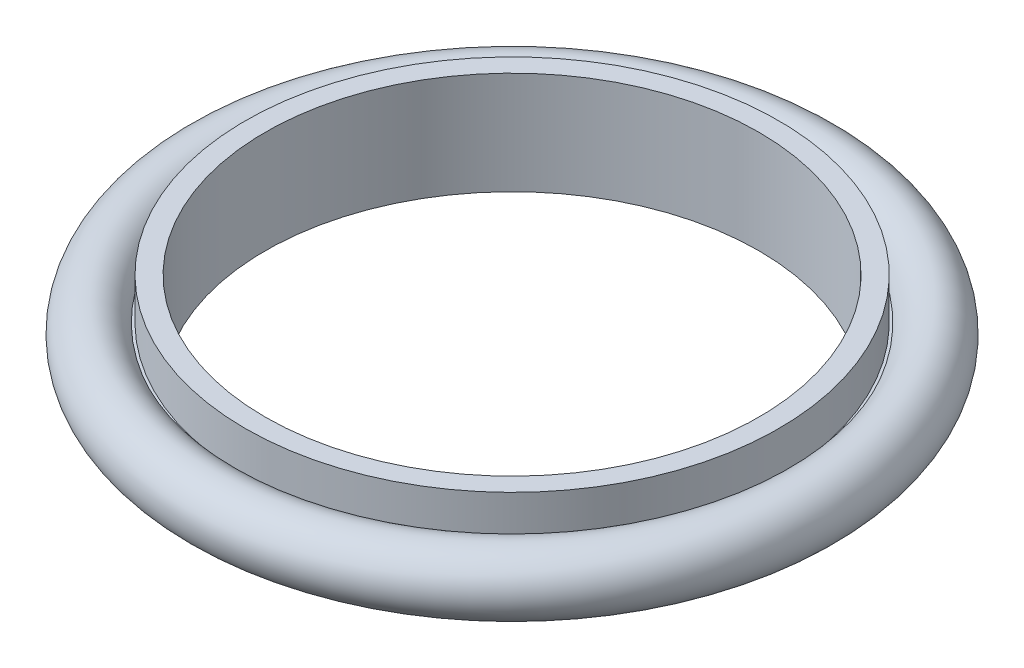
ISO-10303-21;
HEADER;
FILE_DESCRIPTION(('STEP AP214'),'2;1');
FILE_NAME('part.step','',(''),(''),'','','');
FILE_SCHEMA(('AUTOMOTIVE_DESIGN { 1 0 10303 214 1 1 1 1 }'));
ENDSEC;
DATA;
#1=APPLICATION_CONTEXT('core data for automotive mechanical design processes');
#2=APPLICATION_PROTOCOL_DEFINITION('international standard','automotive_design',2000,#1);
#3=PRODUCT_CONTEXT('',#1,'mechanical');
#4=PRODUCT('Part','Part','',(#3));
#5=PRODUCT_RELATED_PRODUCT_CATEGORY('part','',(#4));
#6=PRODUCT_DEFINITION_FORMATION('','',#4);
#7=PRODUCT_DEFINITION_CONTEXT('part definition',#1,'design');
#8=PRODUCT_DEFINITION('design','',#6,#7);
#9=PRODUCT_DEFINITION_SHAPE('','',#8);
#10=(LENGTH_UNIT() NAMED_UNIT(*) SI_UNIT(.MILLI.,.METRE.));
#11=(NAMED_UNIT(*) PLANE_ANGLE_UNIT() SI_UNIT($,.RADIAN.));
#12=(NAMED_UNIT(*) SI_UNIT($,.STERADIAN.) SOLID_ANGLE_UNIT());
#13=UNCERTAINTY_MEASURE_WITH_UNIT(LENGTH_MEASURE(1.E-05),#10,'distance_accuracy_value','');
#14=(GEOMETRIC_REPRESENTATION_CONTEXT(3) GLOBAL_UNCERTAINTY_ASSIGNED_CONTEXT((#13)) GLOBAL_UNIT_ASSIGNED_CONTEXT((#10,
#11,#12)) REPRESENTATION_CONTEXT('',''));
#15=CARTESIAN_POINT('',(0.,0.,0.));
#16=DIRECTION('',(0.,0.,1.));
#17=DIRECTION('',(1.,0.,0.));
#18=AXIS2_PLACEMENT_3D('',#15,#16,#17);
#19=CARTESIAN_POINT('',(0.,0.,0.));
#20=DIRECTION('',(0.,0.999999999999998,0.));
#21=DIRECTION('',(0.,0.,1.));
#22=AXIS2_PLACEMENT_3D('',#19,#20,#21);
#23=CYLINDRICAL_SURFACE('',#22,18.923);
#24=CARTESIAN_POINT('',(0.,0.,0.));
#25=DIRECTION('',(0.,0.999999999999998,0.));
#26=DIRECTION('',(0.,0.,1.));
#27=AXIS2_PLACEMENT_3D('',#24,#25,#26);
#28=CIRCLE('',#27,18.923);
#29=CARTESIAN_POINT('',(0.,0.,18.923));
#30=VERTEX_POINT('',#29);
#31=EDGE_CURVE('E10',#30,#30,#28,.T.);
#32=CARTESIAN_POINT('',(1.11022302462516E-13,7.87399999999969,2.16493489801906E-12));
#33=DIRECTION('',(0.,0.999999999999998,0.));
#34=DIRECTION('',(0.,0.,1.));
#35=AXIS2_PLACEMENT_3D('',#32,#33,#34);
#36=CIRCLE('',#35,18.923);
#37=CARTESIAN_POINT('',(0.,7.87399999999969,18.923));
#38=VERTEX_POINT('',#37);
#39=EDGE_CURVE('E60',#38,#38,#36,.T.);
#40=CARTESIAN_POINT('',(0.,0.,18.923));
#41=CARTESIAN_POINT('',(0.,0.0820208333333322,18.923));
#42=CARTESIAN_POINT('',(0.,0.164041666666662,18.923));
#43=CARTESIAN_POINT('',(0.,0.328083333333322,18.923));
#44=CARTESIAN_POINT('',(0.,0.410104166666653,18.923));
#45=CARTESIAN_POINT('',(0.,0.574145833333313,18.923));
#46=CARTESIAN_POINT('',(0.,0.656166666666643,18.923));
#47=CARTESIAN_POINT('',(0.,0.820208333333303,18.923));
#48=CARTESIAN_POINT('',(0.,0.902229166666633,18.923));
#49=CARTESIAN_POINT('',(0.,1.06627083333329,18.923));
#50=CARTESIAN_POINT('',(0.,1.14829166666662,18.923));
#51=CARTESIAN_POINT('',(0.,1.31233333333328,18.923));
#52=CARTESIAN_POINT('',(0.,1.39435416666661,18.923));
#53=CARTESIAN_POINT('',(0.,1.55839583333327,18.923));
#54=CARTESIAN_POINT('',(0.,1.6404166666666,18.923));
#55=CARTESIAN_POINT('',(0.,1.80445833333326,18.923));
#56=CARTESIAN_POINT('',(0.,1.88647916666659,18.923));
#57=CARTESIAN_POINT('',(0.,2.05052083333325,18.923));
#58=CARTESIAN_POINT('',(0.,2.13254166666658,18.923));
#59=CARTESIAN_POINT('',(0.,2.29658333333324,18.923));
#60=CARTESIAN_POINT('',(0.,2.37860416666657,18.923));
#61=CARTESIAN_POINT('',(0.,2.54264583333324,18.923));
#62=CARTESIAN_POINT('',(0.,2.62466666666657,18.923));
#63=CARTESIAN_POINT('',(0.,2.78870833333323,18.923));
#64=CARTESIAN_POINT('',(0.,2.87072916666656,18.923));
#65=CARTESIAN_POINT('',(0.,3.03477083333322,18.923));
#66=CARTESIAN_POINT('',(0.,3.11679166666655,18.923));
#67=CARTESIAN_POINT('',(0.,3.28083333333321,18.923));
#68=CARTESIAN_POINT('',(0.,3.36285416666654,18.923));
#69=CARTESIAN_POINT('',(0.,3.5268958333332,18.923));
#70=CARTESIAN_POINT('',(0.,3.60891666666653,18.923));
#71=CARTESIAN_POINT('',(0.,3.77295833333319,18.923));
#72=CARTESIAN_POINT('',(0.,3.85497916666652,18.923));
#73=CARTESIAN_POINT('',(0.,4.01902083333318,18.923));
#74=CARTESIAN_POINT('',(0.,4.10104166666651,18.923));
#75=CARTESIAN_POINT('',(0.,4.26508333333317,18.923));
#76=CARTESIAN_POINT('',(0.,4.3471041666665,18.923));
#77=CARTESIAN_POINT('',(0.,4.51114583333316,18.923));
#78=CARTESIAN_POINT('',(0.,4.59316666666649,18.923));
#79=CARTESIAN_POINT('',(0.,4.75720833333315,18.923));
#80=CARTESIAN_POINT('',(0.,4.83922916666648,18.923));
#81=CARTESIAN_POINT('',(0.,5.00327083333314,18.923));
#82=CARTESIAN_POINT('',(0.,5.08529166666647,18.923));
#83=CARTESIAN_POINT('',(0.,5.24933333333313,18.923));
#84=CARTESIAN_POINT('',(0.,5.33135416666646,18.923));
#85=CARTESIAN_POINT('',(0.,5.49539583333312,18.923));
#86=CARTESIAN_POINT('',(0.,5.57741666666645,18.923));
#87=CARTESIAN_POINT('',(0.,5.74145833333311,18.923));
#88=CARTESIAN_POINT('',(0.,5.82347916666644,18.923));
#89=CARTESIAN_POINT('',(0.,5.9875208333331,18.923));
#90=CARTESIAN_POINT('',(0.,6.06954166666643,18.923));
#91=CARTESIAN_POINT('',(0.,6.23358333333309,18.923));
#92=CARTESIAN_POINT('',(0.,6.31560416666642,18.923));
#93=CARTESIAN_POINT('',(0.,6.47964583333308,18.923));
#94=CARTESIAN_POINT('',(0.,6.56166666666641,18.923));
#95=CARTESIAN_POINT('',(0.,6.72570833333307,18.923));
#96=CARTESIAN_POINT('',(0.,6.8077291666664,18.923));
#97=CARTESIAN_POINT('',(0.,6.97177083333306,18.923));
#98=CARTESIAN_POINT('',(0.,7.05379166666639,18.923));
#99=CARTESIAN_POINT('',(0.,7.21783333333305,18.923));
#100=CARTESIAN_POINT('',(0.,7.29985416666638,18.923));
#101=CARTESIAN_POINT('',(0.,7.46389583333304,18.923));
#102=CARTESIAN_POINT('',(0.,7.54591666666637,18.923));
#103=CARTESIAN_POINT('',(0.,7.70995833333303,18.923));
#104=CARTESIAN_POINT('',(0.,7.79197916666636,18.923));
#105=CARTESIAN_POINT('',(0.,7.87399999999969,18.923));
#106=B_SPLINE_CURVE_WITH_KNOTS('',3,(#40,#41,#42,#43,#44,#45,#46,#47,#48,#49,#50,#51,#52,#53,
#54,#55,#56,#57,#58,#59,#60,#61,#62,#63,#64,#65,#66,#67,#68,#69,#70,#71,#72,#73,#74,#75,#76,#77,
#78,#79,#80,#81,#82,#83,#84,#85,#86,#87,#88,#89,#90,#91,#92,#93,#94,#95,#96,#97,#98,#99,#100,
#101,#102,#103,#104,#105),.UNSPECIFIED.,.F.,.F.,(4,2,2,2,2,2,2,2,2,2,2,2,2,2,2,2,2,2,2,2,2,2,2,
2,2,2,2,2,2,2,2,2,4),(0.,0.24606249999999,0.492124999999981,0.738187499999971,0.984249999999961,
1.23031249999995,1.47637499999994,1.72243749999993,1.96849999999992,2.21456249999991,
2.4606249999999,2.70668749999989,2.95274999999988,3.19881249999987,3.44487499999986,
3.69093749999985,3.93699999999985,4.18306249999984,4.42912499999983,4.67518749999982,
4.92124999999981,5.1673124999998,5.41337499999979,5.65943749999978,5.90549999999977,
6.15156249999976,6.39762499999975,6.64368749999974,6.88974999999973,7.13581249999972,
7.38187499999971,7.6279374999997,7.87399999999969),.UNSPECIFIED.);
#107=EDGE_CURVE('BSEAM32',#30,#38,#106,.T.);
#108=ORIENTED_EDGE('',*,*,#31,.F.);
#109=ORIENTED_EDGE('',*,*,#39,.T.);
#110=ORIENTED_EDGE('',*,*,#107,.T.);
#111=ORIENTED_EDGE('',*,*,#107,.F.);
#112=EDGE_LOOP('',(#108,#110,#109,#111));
#113=FACE_BOUND('',#112,.T.);
#114=ADVANCED_FACE('F32',(#113),#23,.F.);
#115=CARTESIAN_POINT('',(1.11022302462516E-13,-4.44089209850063E-13,-18.9230000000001));
#116=DIRECTION('',(0.,0.999999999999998,0.));
#117=DIRECTION('',(0.,0.,1.));
#118=AXIS2_PLACEMENT_3D('',#115,#116,#117);
#119=PLANE('',#118);
#120=CARTESIAN_POINT('',(0.,0.,0.));
#121=DIRECTION('',(0.,0.999999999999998,0.));
#122=DIRECTION('',(0.,0.,1.));
#123=AXIS2_PLACEMENT_3D('',#120,#121,#122);
#124=CIRCLE('',#123,20.447);
#125=CARTESIAN_POINT('',(0.,0.,20.447));
#126=VERTEX_POINT('',#125);
#127=EDGE_CURVE('E38',#126,#126,#124,.T.);
#128=ORIENTED_EDGE('',*,*,#127,.F.);
#129=EDGE_LOOP('',(#128));
#130=FACE_BOUND('',#129,.T.);
#131=ORIENTED_EDGE('',*,*,#31,.T.);
#132=EDGE_LOOP('',(#131));
#133=FACE_BOUND('',#132,.T.);
#134=ADVANCED_FACE('F97',(#130,#133),#119,.F.);
#135=CARTESIAN_POINT('',(0.,0.,0.));
#136=DIRECTION('',(0.,0.999999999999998,0.));
#137=DIRECTION('',(0.,0.,1.));
#138=AXIS2_PLACEMENT_3D('',#135,#136,#137);
#139=CYLINDRICAL_SURFACE('',#138,20.447);
#140=CARTESIAN_POINT('',(-2.22044604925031E-13,3.37940121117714,3.88578058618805E-13));
#141=DIRECTION('',(0.,0.999999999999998,0.));
#142=DIRECTION('',(0.,0.,1.));
#143=AXIS2_PLACEMENT_3D('',#140,#141,#142);
#144=CIRCLE('',#143,20.447);
#145=CARTESIAN_POINT('',(0.,3.37940121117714,20.447));
#146=VERTEX_POINT('',#145);
#147=EDGE_CURVE('E42',#146,#146,#144,.T.);
#148=CARTESIAN_POINT('',(0.,3.37940121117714,20.447));
#149=CARTESIAN_POINT('',(0.,3.34419911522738,20.447));
#150=CARTESIAN_POINT('',(0.,3.30899701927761,20.447));
#151=CARTESIAN_POINT('',(0.,3.23859282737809,20.447));
#152=CARTESIAN_POINT('',(0.,3.20339073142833,20.447));
#153=CARTESIAN_POINT('',(0.,3.13298653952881,20.447));
#154=CARTESIAN_POINT('',(0.,3.09778444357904,20.447));
#155=CARTESIAN_POINT('',(0.,3.02738025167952,20.447));
#156=CARTESIAN_POINT('',(0.,2.99217815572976,20.447));
#157=CARTESIAN_POINT('',(0.,2.92177396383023,20.447));
#158=CARTESIAN_POINT('',(0.,2.88657186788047,20.447));
#159=CARTESIAN_POINT('',(0.,2.81616767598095,20.447));
#160=CARTESIAN_POINT('',(0.,2.78096558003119,20.447));
#161=CARTESIAN_POINT('',(0.,2.71056138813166,20.447));
#162=CARTESIAN_POINT('',(0.,2.6753592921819,20.447));
#163=CARTESIAN_POINT('',(0.,2.60495510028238,20.447));
#164=CARTESIAN_POINT('',(0.,2.56975300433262,20.447));
#165=CARTESIAN_POINT('',(0.,2.49934881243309,20.447));
#166=CARTESIAN_POINT('',(0.,2.46414671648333,20.447));
#167=CARTESIAN_POINT('',(0.,2.39374252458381,20.447));
#168=CARTESIAN_POINT('',(0.,2.35854042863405,20.447));
#169=CARTESIAN_POINT('',(0.,2.28813623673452,20.447));
#170=CARTESIAN_POINT('',(0.,2.25293414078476,20.447));
#171=CARTESIAN_POINT('',(0.,2.18252994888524,20.447));
#172=CARTESIAN_POINT('',(0.,2.14732785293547,20.447));
#173=CARTESIAN_POINT('',(0.,2.07692366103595,20.447));
#174=CARTESIAN_POINT('',(0.,2.04172156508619,20.447));
#175=CARTESIAN_POINT('',(0.,1.97131737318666,20.447));
#176=CARTESIAN_POINT('',(0.,1.9361152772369,20.447));
#177=CARTESIAN_POINT('',(0.,1.86571108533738,20.447));
#178=CARTESIAN_POINT('',(0.,1.83050898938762,20.447));
#179=CARTESIAN_POINT('',(0.,1.76010479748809,20.447));
#180=CARTESIAN_POINT('',(0.,1.72490270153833,20.447));
#181=CARTESIAN_POINT('',(0.,1.65449850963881,20.447));
#182=CARTESIAN_POINT('',(0.,1.61929641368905,20.447));
#183=CARTESIAN_POINT('',(0.,1.54889222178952,20.447));
#184=CARTESIAN_POINT('',(0.,1.51369012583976,20.447));
#185=CARTESIAN_POINT('',(0.,1.44328593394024,20.447));
#186=CARTESIAN_POINT('',(0.,1.40808383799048,20.447));
#187=CARTESIAN_POINT('',(0.,1.33767964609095,20.447));
#188=CARTESIAN_POINT('',(0.,1.30247755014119,20.447));
#189=CARTESIAN_POINT('',(0.,1.23207335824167,20.447));
#190=CARTESIAN_POINT('',(0.,1.1968712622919,20.447));
#191=CARTESIAN_POINT('',(0.,1.12646707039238,20.447));
#192=CARTESIAN_POINT('',(0.,1.09126497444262,20.447));
#193=CARTESIAN_POINT('',(0.,1.0208607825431,20.447));
#194=CARTESIAN_POINT('',(0.,0.985658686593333,20.447));
#195=CARTESIAN_POINT('',(0.,0.91525449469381,20.447));
#196=CARTESIAN_POINT('',(0.,0.880052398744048,20.447));
#197=CARTESIAN_POINT('',(0.,0.809648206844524,20.447));
#198=CARTESIAN_POINT('',(0.,0.774446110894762,20.447));
#199=CARTESIAN_POINT('',(0.,0.704041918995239,20.447));
#200=CARTESIAN_POINT('',(0.,0.668839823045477,20.447));
#201=CARTESIAN_POINT('',(0.,0.598435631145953,20.447));
#202=CARTESIAN_POINT('',(0.,0.563233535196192,20.447));
#203=CARTESIAN_POINT('',(0.,0.492829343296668,20.447));
#204=CARTESIAN_POINT('',(0.,0.457627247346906,20.447));
#205=CARTESIAN_POINT('',(0.,0.387223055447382,20.447));
#206=CARTESIAN_POINT('',(0.,0.352020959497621,20.447));
#207=CARTESIAN_POINT('',(0.,0.281616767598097,20.447));
#208=CARTESIAN_POINT('',(0.,0.246414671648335,20.447));
#209=CARTESIAN_POINT('',(0.,0.176010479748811,20.447));
#210=CARTESIAN_POINT('',(0.,0.14080838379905,20.447));
#211=CARTESIAN_POINT('',(0.,0.0704041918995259,20.447));
#212=CARTESIAN_POINT('',(0.,0.0352020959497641,20.447));
#213=CARTESIAN_POINT('',(0.,0.,20.447));
#214=B_SPLINE_CURVE_WITH_KNOTS('',3,(#148,#149,#150,#151,#152,#153,#154,#155,#156,#157,#158,
#159,#160,#161,#162,#163,#164,#165,#166,#167,#168,#169,#170,#171,#172,#173,#174,#175,#176,#177,
#178,#179,#180,#181,#182,#183,#184,#185,#186,#187,#188,#189,#190,#191,#192,#193,#194,#195,#196,
#197,#198,#199,#200,#201,#202,#203,#204,#205,#206,#207,#208,#209,#210,#211,#212,#213),
.UNSPECIFIED.,.F.,.F.,(4,2,2,2,2,2,2,2,2,2,2,2,2,2,2,2,2,2,2,2,2,2,2,2,2,2,2,2,2,2,2,2,4),(0.,
0.105606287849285,0.211212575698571,0.316818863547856,0.422425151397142,0.528031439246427,
0.633637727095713,0.739244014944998,0.844850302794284,0.950456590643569,1.05606287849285,
1.16166916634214,1.26727545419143,1.37288174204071,1.47848802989,1.58409431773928,
1.68970060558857,1.79530689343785,1.90091318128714,2.00651946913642,2.11212575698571,
2.217732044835,2.32333833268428,2.42894462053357,2.53455090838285,2.64015719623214,
2.74576348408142,2.85136977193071,2.95697605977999,3.06258234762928,3.16818863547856,
3.27379492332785,3.37940121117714),.UNSPECIFIED.);
#215=EDGE_CURVE('BSEAM92',#146,#126,#214,.T.);
#216=ORIENTED_EDGE('',*,*,#147,.F.);
#217=ORIENTED_EDGE('',*,*,#127,.T.);
#218=ORIENTED_EDGE('',*,*,#215,.T.);
#219=ORIENTED_EDGE('',*,*,#215,.F.);
#220=EDGE_LOOP('',(#216,#218,#217,#219));
#221=FACE_BOUND('',#220,.T.);
#222=ADVANCED_FACE('F92',(#221),#139,.T.);
#223=CARTESIAN_POINT('',(-2.22044604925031E-13,3.37940121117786,-20.4469999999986));
#224=DIRECTION('',(0.,0.999999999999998,0.));
#225=DIRECTION('',(0.,0.,1.));
#226=AXIS2_PLACEMENT_3D('',#223,#224,#225);
#227=PLANE('',#226);
#228=CARTESIAN_POINT('',(-2.22044604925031E-13,3.37940121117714,3.88578058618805E-13));
#229=DIRECTION('',(0.,0.999999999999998,0.));
#230=DIRECTION('',(0.,0.,1.));
#231=AXIS2_PLACEMENT_3D('',#228,#229,#230);
#232=CIRCLE('',#231,20.5895867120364);
#233=CARTESIAN_POINT('',(-2.2090165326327E-13,3.37940121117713,20.5895867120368));
#234=VERTEX_POINT('',#233);
#235=EDGE_CURVE('E46',#234,#234,#232,.T.);
#236=ORIENTED_EDGE('',*,*,#235,.F.);
#237=EDGE_LOOP('',(#236));
#238=FACE_BOUND('',#237,.T.);
#239=ORIENTED_EDGE('',*,*,#147,.T.);
#240=EDGE_LOOP('',(#239));
#241=FACE_BOUND('',#240,.T.);
#242=ADVANCED_FACE('F86',(#238,#241),#227,.F.);
#243=CARTESIAN_POINT('',(0.,3.93699999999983,3.88578058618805E-13));
#244=DIRECTION('',(0.,0.999999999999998,0.));
#245=DIRECTION('',(0.,0.,1.));
#246=AXIS2_PLACEMENT_3D('',#243,#244,#245);
#247=TOROIDAL_SURFACE('',#246,22.8981,2.3749);
#248=CARTESIAN_POINT('',(3.33066907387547E-13,4.68731962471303,1.27675647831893E-12));
#249=DIRECTION('',(0.,0.999999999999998,0.));
#250=DIRECTION('',(0.,0.,1.));
#251=AXIS2_PLACEMENT_3D('',#248,#249,#250);
#252=CIRCLE('',#251,20.6448422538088);
#253=CARTESIAN_POINT('',(3.34212926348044E-13,4.68731962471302,20.64484225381));
#254=VERTEX_POINT('',#253);
#255=EDGE_CURVE('E51',#254,#254,#252,.T.);
#256=ORIENTED_EDGE('',*,*,#255,.F.);
#257=EDGE_LOOP('',(#256));
#258=FACE_BOUND('',#257,.T.);
#259=ORIENTED_EDGE('',*,*,#235,.T.);
#260=EDGE_LOOP('',(#259));
#261=FACE_BOUND('',#260,.T.);
#262=ADVANCED_FACE('F80',(#258,#261),#247,.T.);
#263=CARTESIAN_POINT('',(-4.44089209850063E-13,4.68731962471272,-20.4469999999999));
#264=DIRECTION('',(0.,-0.999999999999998,0.));
#265=DIRECTION('',(0.,0.,-1.));
#266=AXIS2_PLACEMENT_3D('',#263,#264,#265);
#267=PLANE('',#266);
#268=CARTESIAN_POINT('',(3.33066907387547E-13,4.68731962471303,1.27675647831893E-12));
#269=DIRECTION('',(0.,0.999999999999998,0.));
#270=DIRECTION('',(0.,0.,1.));
#271=AXIS2_PLACEMENT_3D('',#268,#269,#270);
#272=CIRCLE('',#271,20.447);
#273=CARTESIAN_POINT('',(0.,4.68731962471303,20.447));
#274=VERTEX_POINT('',#273);
#275=EDGE_CURVE('E54',#274,#274,#272,.T.);
#276=ORIENTED_EDGE('',*,*,#275,.F.);
#277=EDGE_LOOP('',(#276));
#278=FACE_BOUND('',#277,.T.);
#279=ORIENTED_EDGE('',*,*,#255,.T.);
#280=EDGE_LOOP('',(#279));
#281=FACE_BOUND('',#280,.T.);
#282=ADVANCED_FACE('F74',(#278,#281),#267,.F.);
#283=CARTESIAN_POINT('',(0.,0.,0.));
#284=DIRECTION('',(0.,0.999999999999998,0.));
#285=DIRECTION('',(0.,0.,1.));
#286=AXIS2_PLACEMENT_3D('',#283,#284,#285);
#287=CYLINDRICAL_SURFACE('',#286,20.447);
#288=CARTESIAN_POINT('',(1.11022302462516E-13,7.87399999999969,2.16493489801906E-12));
#289=DIRECTION('',(0.,0.999999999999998,0.));
#290=DIRECTION('',(0.,0.,1.));
#291=AXIS2_PLACEMENT_3D('',#288,#289,#290);
#292=CIRCLE('',#291,20.447);
#293=CARTESIAN_POINT('',(0.,7.87399999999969,20.447));
#294=VERTEX_POINT('',#293);
#295=EDGE_CURVE('E57',#294,#294,#292,.T.);
#296=CARTESIAN_POINT('',(0.,7.87399999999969,20.447));
#297=CARTESIAN_POINT('',(0.,7.84080541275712,20.447));
#298=CARTESIAN_POINT('',(0.,7.80761082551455,20.447));
#299=CARTESIAN_POINT('',(0.,7.74122165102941,20.447));
#300=CARTESIAN_POINT('',(0.,7.70802706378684,20.447));
#301=CARTESIAN_POINT('',(0.,7.6416378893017,20.447));
#302=CARTESIAN_POINT('',(0.,7.60844330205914,20.447));
#303=CARTESIAN_POINT('',(0.,7.542054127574,20.447));
#304=CARTESIAN_POINT('',(0.,7.50885954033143,20.447));
#305=CARTESIAN_POINT('',(0.,7.44247036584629,20.447));
#306=CARTESIAN_POINT('',(0.,7.40927577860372,20.447));
#307=CARTESIAN_POINT('',(0.,7.34288660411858,20.447));
#308=CARTESIAN_POINT('',(0.,7.30969201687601,20.447));
#309=CARTESIAN_POINT('',(0.,7.24330284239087,20.447));
#310=CARTESIAN_POINT('',(0.,7.2101082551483,20.447));
#311=CARTESIAN_POINT('',(0.,7.14371908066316,20.447));
#312=CARTESIAN_POINT('',(0.,7.11052449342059,20.447));
#313=CARTESIAN_POINT('',(0.,7.04413531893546,20.447));
#314=CARTESIAN_POINT('',(0.,7.01094073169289,20.447));
#315=CARTESIAN_POINT('',(0.,6.94455155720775,20.447));
#316=CARTESIAN_POINT('',(0.,6.91135696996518,20.447));
#317=CARTESIAN_POINT('',(0.,6.84496779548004,20.447));
#318=CARTESIAN_POINT('',(0.,6.81177320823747,20.447));
#319=CARTESIAN_POINT('',(0.,6.74538403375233,20.447));
#320=CARTESIAN_POINT('',(0.,6.71218944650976,20.447));
#321=CARTESIAN_POINT('',(0.,6.64580027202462,20.447));
#322=CARTESIAN_POINT('',(0.,6.61260568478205,20.447));
#323=CARTESIAN_POINT('',(0.,6.54621651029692,20.447));
#324=CARTESIAN_POINT('',(0.,6.51302192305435,20.447));
#325=CARTESIAN_POINT('',(0.,6.44663274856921,20.447));
#326=CARTESIAN_POINT('',(0.,6.41343816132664,20.447));
#327=CARTESIAN_POINT('',(0.,6.3470489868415,20.447));
#328=CARTESIAN_POINT('',(0.,6.31385439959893,20.447));
#329=CARTESIAN_POINT('',(0.,6.24746522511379,20.447));
#330=CARTESIAN_POINT('',(0.,6.21427063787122,20.447));
#331=CARTESIAN_POINT('',(0.,6.14788146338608,20.447));
#332=CARTESIAN_POINT('',(0.,6.11468687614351,20.447));
#333=CARTESIAN_POINT('',(0.,6.04829770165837,20.447));
#334=CARTESIAN_POINT('',(0.,6.0151031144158,20.447));
#335=CARTESIAN_POINT('',(0.,5.94871393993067,20.447));
#336=CARTESIAN_POINT('',(0.,5.9155193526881,20.447));
#337=CARTESIAN_POINT('',(0.,5.84913017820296,20.447));
#338=CARTESIAN_POINT('',(0.,5.81593559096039,20.447));
#339=CARTESIAN_POINT('',(0.,5.74954641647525,20.447));
#340=CARTESIAN_POINT('',(0.,5.71635182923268,20.447));
#341=CARTESIAN_POINT('',(0.,5.64996265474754,20.447));
#342=CARTESIAN_POINT('',(0.,5.61676806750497,20.447));
#343=CARTESIAN_POINT('',(0.,5.55037889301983,20.447));
#344=CARTESIAN_POINT('',(0.,5.51718430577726,20.447));
#345=CARTESIAN_POINT('',(0.,5.45079513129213,20.447));
#346=CARTESIAN_POINT('',(0.,5.41760054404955,20.447));
#347=CARTESIAN_POINT('',(0.,5.35121136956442,20.447));
#348=CARTESIAN_POINT('',(0.,5.31801678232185,20.447));
#349=CARTESIAN_POINT('',(0.,5.25162760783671,20.447));
#350=CARTESIAN_POINT('',(0.,5.21843302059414,20.447));
#351=CARTESIAN_POINT('',(0.,5.152043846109,20.447));
#352=CARTESIAN_POINT('',(0.,5.11884925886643,20.447));
#353=CARTESIAN_POINT('',(0.,5.05246008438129,20.447));
#354=CARTESIAN_POINT('',(0.,5.01926549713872,20.447));
#355=CARTESIAN_POINT('',(0.,4.95287632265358,20.447));
#356=CARTESIAN_POINT('',(0.,4.91968173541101,20.447));
#357=CARTESIAN_POINT('',(0.,4.85329256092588,20.447));
#358=CARTESIAN_POINT('',(0.,4.82009797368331,20.447));
#359=CARTESIAN_POINT('',(0.,4.75370879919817,20.447));
#360=CARTESIAN_POINT('',(0.,4.7205142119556,20.447));
#361=CARTESIAN_POINT('',(0.,4.68731962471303,20.447));
#362=B_SPLINE_CURVE_WITH_KNOTS('',3,(#296,#297,#298,#299,#300,#301,#302,#303,#304,#305,#306,
#307,#308,#309,#310,#311,#312,#313,#314,#315,#316,#317,#318,#319,#320,#321,#322,#323,#324,#325,
#326,#327,#328,#329,#330,#331,#332,#333,#334,#335,#336,#337,#338,#339,#340,#341,#342,#343,#344,
#345,#346,#347,#348,#349,#350,#351,#352,#353,#354,#355,#356,#357,#358,#359,#360,#361),
.UNSPECIFIED.,.F.,.F.,(4,2,2,2,2,2,2,2,2,2,2,2,2,2,2,2,2,2,2,2,2,2,2,2,2,2,2,2,2,2,2,2,4),(0.,
0.0995837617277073,0.199167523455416,0.298751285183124,0.398335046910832,0.49791880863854,
0.597502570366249,0.697086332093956,0.796670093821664,0.896253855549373,0.995837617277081,
1.09542137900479,1.1950051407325,1.29458890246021,1.39417266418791,1.49375642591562,
1.59334018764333,1.69292394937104,1.79250771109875,1.89209147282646,1.99167523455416,
2.09125899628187,2.19084275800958,2.29042651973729,2.390010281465,2.4895940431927,
2.58917780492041,2.68876156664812,2.78834532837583,2.88792909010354,2.98751285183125,
3.08709661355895,3.18668037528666),.UNSPECIFIED.);
#363=EDGE_CURVE('BSEAM68',#294,#274,#362,.T.);
#364=ORIENTED_EDGE('',*,*,#295,.F.);
#365=ORIENTED_EDGE('',*,*,#275,.T.);
#366=ORIENTED_EDGE('',*,*,#363,.T.);
#367=ORIENTED_EDGE('',*,*,#363,.F.);
#368=EDGE_LOOP('',(#364,#366,#365,#367));
#369=FACE_BOUND('',#368,.T.);
#370=ADVANCED_FACE('F68',(#369),#287,.T.);
#371=CARTESIAN_POINT('',(-1.11022302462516E-13,7.8739999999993,-18.9229999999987));
#372=DIRECTION('',(0.,-0.999999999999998,0.));
#373=DIRECTION('',(0.,0.,-1.));
#374=AXIS2_PLACEMENT_3D('',#371,#372,#373);
#375=PLANE('',#374);
#376=ORIENTED_EDGE('',*,*,#39,.F.);
#377=EDGE_LOOP('',(#376));
#378=FACE_BOUND('',#377,.T.);
#379=ORIENTED_EDGE('',*,*,#295,.T.);
#380=EDGE_LOOP('',(#379));
#381=FACE_BOUND('',#380,.T.);
#382=ADVANCED_FACE('F65',(#378,#381),#375,.F.);
#383=CLOSED_SHELL('',(#114,#134,#222,#242,#262,#282,#370,#382));
#384=MANIFOLD_SOLID_BREP('B2',#383);
#385=ADVANCED_BREP_SHAPE_REPRESENTATION('',(#18,#384),#14);
#386=SHAPE_DEFINITION_REPRESENTATION(#9,#385);
ENDSEC;
END-ISO-10303-21;
